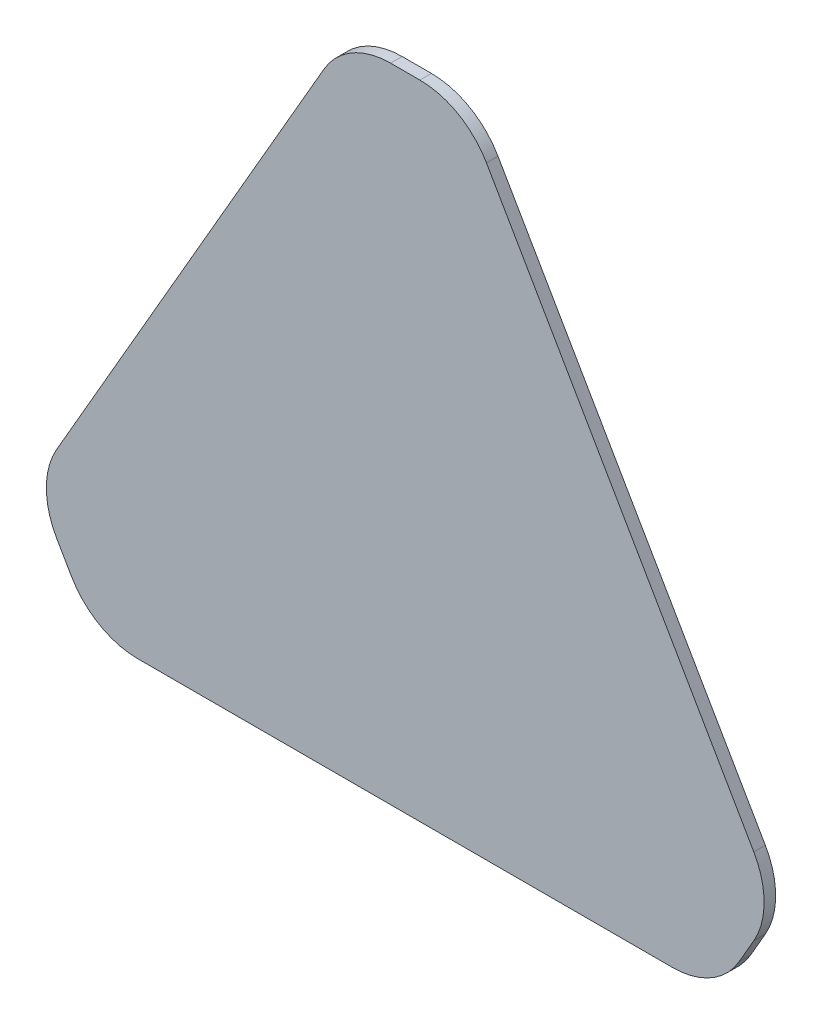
from build123d import *

# Parameters (mm, degrees)
BOSS_EXTRUDE1_DEPTH = 3


with BuildPart() as part:
    # Sketch1 → Boss-Extrude1 (new body)
    with BuildSketch(Plane.XY):
        with BuildLine():
            Line((3.811978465, 102.5), (-3.811978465, 102.5))
            ThreePointArc((-3.811978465, 102.5), (-13.811978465, 99.820508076), (-21.132486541, 92.5))
            Line((-21.132486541, 92.5), (-90.67359312, -27.948729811))
            ThreePointArc((-90.67359312, -27.948729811), (-93.353085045, -37.948729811), (-90.67359312, -47.948729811))
            Line((-90.67359312, -47.948729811), (-86.861614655, -54.551270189))
            ThreePointArc((-86.861614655, -54.551270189), (-79.54110658, -61.871778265), (-69.54110658, -64.551270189))
            Line((-69.54110658, -64.551270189), (69.54110658, -64.551270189))
            ThreePointArc((69.54110658, -64.551270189), (79.54110658, -61.871778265), (86.861614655, -54.551270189))
            Line((86.861614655, -54.551270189), (90.67359312, -47.948729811))
            ThreePointArc((90.67359312, -47.948729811), (93.353085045, -37.948729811), (90.67359312, -27.948729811))
            Line((90.67359312, -27.948729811), (21.132486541, 92.5))
            ThreePointArc((21.132486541, 92.5), (13.811978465, 99.820508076), (3.811978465, 102.5))
        make_face()
    extrude(amount=BOSS_EXTRUDE1_DEPTH)


solid = part.part
